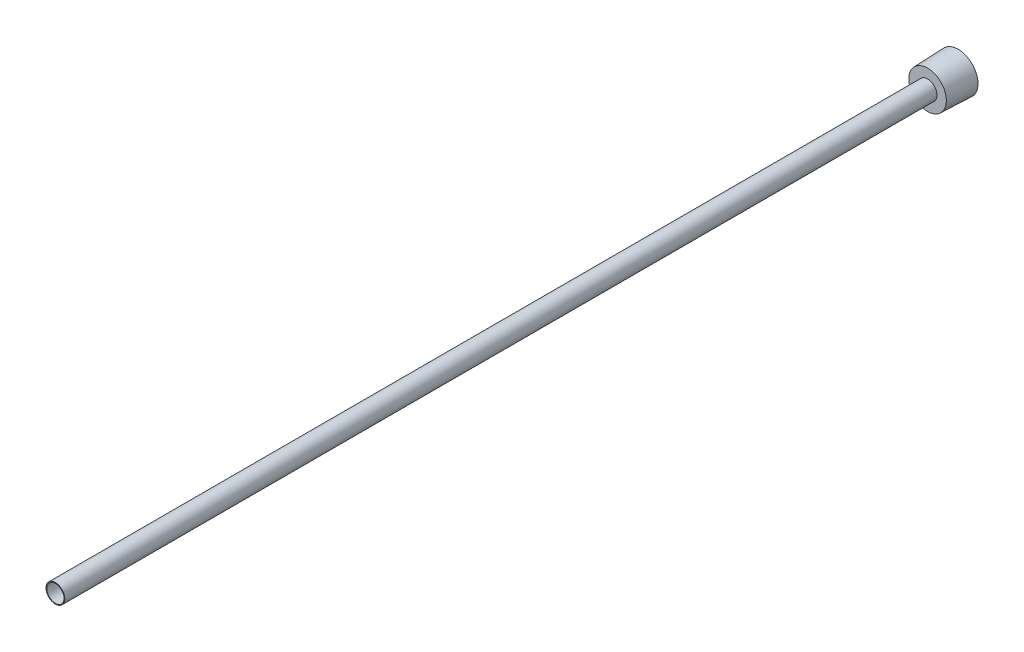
from build123d import *

# Parameters (mm, degrees)
SKETCH2_R          = 2.921
CUT_EXTRUDE1_DEPTH = 305.948046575
CUT_EXTRUDE2_DEPTH = 6.35


with BuildPart() as part:
    # Sketch1 → Revolve1 (revolve)
    with BuildSketch(Plane(origin=(0, 0, 0), x_dir=(0, 0, -1), z_dir=(1, 0, 0)), mode=Mode.PRIVATE) as revolve1_sk:
        Polygon((0, 0), (-304.8, 0), (-304.8, 3.175), (-10.3124, 3.175), (-10.3124, 6.342143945), (0, 6.7183), align=None)
    revolve(revolve1_sk.sketch.rotate(Axis((0, 0, 331.124179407), (0, 0, -1)), 90), axis=Axis((0, 0, 331.124179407), (0, 0, -1)))

    # Sketch2 → Cut-Extrude1 (cut, through all)
    with BuildSketch(Plane.XY.offset(304.8)):
        Circle(SKETCH2_R)
    extrude(amount=-CUT_EXTRUDE1_DEPTH, mode=Mode.SUBTRACT)

    # Sketch3 → Cut-Extrude2 (cut)
    with BuildSketch(Plane(origin=(0, 0, 0), x_dir=(-1, 0, 0), z_dir=(0, 0, -1))):
        Polygon((-3.175, -1.833087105), (0, -3.666174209), (3.175, -1.833087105), (3.175, 1.833087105), (0, 3.666174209), (-3.175, 1.833087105), align=None)
    extrude(amount=-CUT_EXTRUDE2_DEPTH, mode=Mode.SUBTRACT)


solid = part.part
